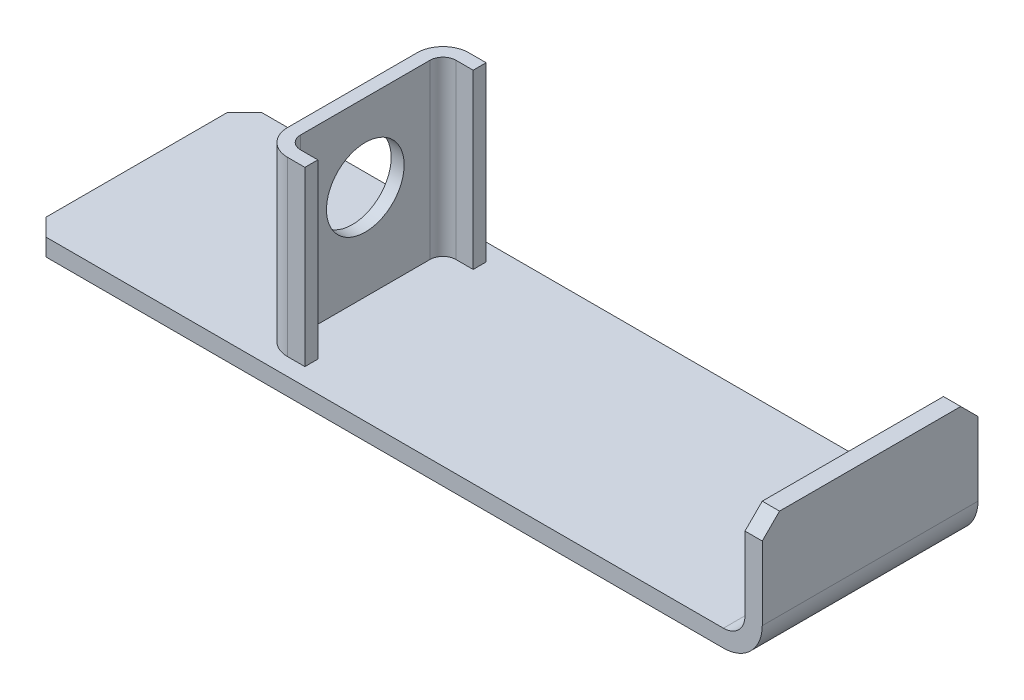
ISO-10303-21;
HEADER;
FILE_DESCRIPTION(('STEP AP214'),'2;1');
FILE_NAME('part.step','',(''),(''),'','','');
FILE_SCHEMA(('AUTOMOTIVE_DESIGN { 1 0 10303 214 1 1 1 1 }'));
ENDSEC;
DATA;
#1=APPLICATION_CONTEXT('core data for automotive mechanical design processes');
#2=APPLICATION_PROTOCOL_DEFINITION('international standard','automotive_design',2000,#1);
#3=PRODUCT_CONTEXT('',#1,'mechanical');
#4=PRODUCT('Part','Part','',(#3));
#5=PRODUCT_RELATED_PRODUCT_CATEGORY('part','',(#4));
#6=PRODUCT_DEFINITION_FORMATION('','',#4);
#7=PRODUCT_DEFINITION_CONTEXT('part definition',#1,'design');
#8=PRODUCT_DEFINITION('design','',#6,#7);
#9=PRODUCT_DEFINITION_SHAPE('','',#8);
#10=(LENGTH_UNIT() NAMED_UNIT(*) SI_UNIT(.MILLI.,.METRE.));
#11=(NAMED_UNIT(*) PLANE_ANGLE_UNIT() SI_UNIT($,.RADIAN.));
#12=(NAMED_UNIT(*) SI_UNIT($,.STERADIAN.) SOLID_ANGLE_UNIT());
#13=UNCERTAINTY_MEASURE_WITH_UNIT(LENGTH_MEASURE(1.E-05),#10,'distance_accuracy_value','');
#14=(GEOMETRIC_REPRESENTATION_CONTEXT(3) GLOBAL_UNCERTAINTY_ASSIGNED_CONTEXT((#13)) GLOBAL_UNIT_ASSIGNED_CONTEXT((#10,
#11,#12)) REPRESENTATION_CONTEXT('',''));
#15=CARTESIAN_POINT('',(0.,0.,0.));
#16=DIRECTION('',(0.,0.,1.));
#17=DIRECTION('',(1.,0.,0.));
#18=AXIS2_PLACEMENT_3D('',#15,#16,#17);
#19=CARTESIAN_POINT('',(-170.,4.,25.));
#20=DIRECTION('',(0.,1.,0.));
#21=DIRECTION('',(0.,0.,1.));
#22=AXIS2_PLACEMENT_3D('',#19,#20,#21);
#23=PLANE('',#22);
#24=DIRECTION('',(1.,0.,0.));
#25=VECTOR('',#24,1.);
#26=CARTESIAN_POINT('',(-170.,4.,-25.));
#27=LINE('',#26,#25);
#28=CARTESIAN_POINT('',(-166.,4.,-25.));
#29=VERTEX_POINT('',#28);
#30=CARTESIAN_POINT('',(-9.00000000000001,4.,-25.));
#31=VERTEX_POINT('',#30);
#32=EDGE_CURVE('E307',#29,#31,#27,.T.);
#33=ORIENTED_EDGE('',*,*,#32,.F.);
#34=DIRECTION('',(-0.707106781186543,0.,0.707106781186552));
#35=VECTOR('',#34,1.);
#36=CARTESIAN_POINT('',(-193.,4.,2.00000000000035));
#37=LINE('',#36,#35);
#38=CARTESIAN_POINT('',(-170.,4.,-20.9999999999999));
#39=VERTEX_POINT('',#38);
#40=EDGE_CURVE('E356',#29,#39,#37,.T.);
#41=ORIENTED_EDGE('',*,*,#40,.T.);
#42=DIRECTION('',(0.,0.,-1.));
#43=VECTOR('',#42,1.);
#44=CARTESIAN_POINT('',(-170.,4.,25.));
#45=LINE('',#44,#43);
#46=CARTESIAN_POINT('',(-170.,4.,21.));
#47=VERTEX_POINT('',#46);
#48=EDGE_CURVE('E336',#47,#39,#45,.T.);
#49=ORIENTED_EDGE('',*,*,#48,.F.);
#50=DIRECTION('',(-0.707106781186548,0.,-0.707106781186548));
#51=VECTOR('',#50,1.);
#52=CARTESIAN_POINT('',(-168.,4.,23.));
#53=LINE('',#52,#51);
#54=CARTESIAN_POINT('',(-166.,4.,25.));
#55=VERTEX_POINT('',#54);
#56=EDGE_CURVE('E354',#47,#55,#53,.F.);
#57=ORIENTED_EDGE('',*,*,#56,.T.);
#58=DIRECTION('',(1.,0.,0.));
#59=VECTOR('',#58,1.);
#60=CARTESIAN_POINT('',(-170.,4.,25.));
#61=LINE('',#60,#59);
#62=CARTESIAN_POINT('',(-9.00000000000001,4.,25.));
#63=VERTEX_POINT('',#62);
#64=EDGE_CURVE('E321',#55,#63,#61,.T.);
#65=ORIENTED_EDGE('',*,*,#64,.T.);
#66=DIRECTION('',(0.,0.,-1.));
#67=VECTOR('',#66,1.);
#68=CARTESIAN_POINT('',(-9.00000000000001,4.,25.));
#69=LINE('',#68,#67);
#70=EDGE_CURVE('E339',#63,#31,#69,.T.);
#71=ORIENTED_EDGE('',*,*,#70,.T.);
#72=EDGE_LOOP('',(#33,#41,#49,#57,#65,#71));
#73=FACE_BOUND('',#72,.T.);
#74=DIRECTION('',(0.,0.,1.));
#75=VECTOR('',#74,1.);
#76=CARTESIAN_POINT('',(-110.,4.,-21.));
#77=LINE('',#76,#75);
#78=CARTESIAN_POINT('',(-110.,4.,-21.));
#79=VERTEX_POINT('',#78);
#80=CARTESIAN_POINT('',(-110.,4.,-18.));
#81=VERTEX_POINT('',#80);
#82=EDGE_CURVE('E199',#79,#81,#77,.T.);
#83=ORIENTED_EDGE('',*,*,#82,.T.);
#84=DIRECTION('',(-1.,0.,0.));
#85=VECTOR('',#84,1.);
#86=CARTESIAN_POINT('',(-114.,4.,-18.));
#87=LINE('',#86,#85);
#88=CARTESIAN_POINT('',(-114.,4.,-18.));
#89=VERTEX_POINT('',#88);
#90=EDGE_CURVE('E210',#89,#81,#87,.F.);
#91=ORIENTED_EDGE('',*,*,#90,.F.);
#92=CARTESIAN_POINT('',(-114.,4.,-15.));
#93=DIRECTION('',(0.,1.,0.));
#94=DIRECTION('',(-1.,0.,0.));
#95=AXIS2_PLACEMENT_3D('',#92,#93,#94);
#96=CIRCLE('',#95,3.);
#97=CARTESIAN_POINT('',(-117.,4.,-15.));
#98=VERTEX_POINT('',#97);
#99=EDGE_CURVE('E246',#98,#89,#96,.F.);
#100=ORIENTED_EDGE('',*,*,#99,.F.);
#101=DIRECTION('',(0.,0.,1.));
#102=VECTOR('',#101,1.);
#103=CARTESIAN_POINT('',(-117.,4.,-15.));
#104=LINE('',#103,#102);
#105=CARTESIAN_POINT('',(-117.,4.,15.));
#106=VERTEX_POINT('',#105);
#107=EDGE_CURVE('E243',#106,#98,#104,.F.);
#108=ORIENTED_EDGE('',*,*,#107,.F.);
#109=CARTESIAN_POINT('',(-114.,4.,15.));
#110=DIRECTION('',(0.,1.,0.));
#111=DIRECTION('',(-1.,0.,0.));
#112=AXIS2_PLACEMENT_3D('',#109,#110,#111);
#113=CIRCLE('',#112,3.);
#114=CARTESIAN_POINT('',(-114.,4.,18.));
#115=VERTEX_POINT('',#114);
#116=EDGE_CURVE('E241',#115,#106,#113,.F.);
#117=ORIENTED_EDGE('',*,*,#116,.F.);
#118=DIRECTION('',(-1.,0.,0.));
#119=VECTOR('',#118,1.);
#120=CARTESIAN_POINT('',(-114.,4.,18.));
#121=LINE('',#120,#119);
#122=CARTESIAN_POINT('',(-110.,4.,18.));
#123=VERTEX_POINT('',#122);
#124=EDGE_CURVE('E239',#123,#115,#121,.T.);
#125=ORIENTED_EDGE('',*,*,#124,.F.);
#126=DIRECTION('',(0.,0.,1.));
#127=VECTOR('',#126,1.);
#128=CARTESIAN_POINT('',(-110.,4.,18.));
#129=LINE('',#128,#127);
#130=CARTESIAN_POINT('',(-110.,4.,21.));
#131=VERTEX_POINT('',#130);
#132=EDGE_CURVE('E236',#123,#131,#129,.T.);
#133=ORIENTED_EDGE('',*,*,#132,.T.);
#134=DIRECTION('',(-1.,0.,0.));
#135=VECTOR('',#134,1.);
#136=CARTESIAN_POINT('',(-114.,4.,21.));
#137=LINE('',#136,#135);
#138=CARTESIAN_POINT('',(-114.,4.,21.));
#139=VERTEX_POINT('',#138);
#140=EDGE_CURVE('E233',#131,#139,#137,.T.);
#141=ORIENTED_EDGE('',*,*,#140,.T.);
#142=CARTESIAN_POINT('',(-114.,4.,15.));
#143=DIRECTION('',(0.,-1.,0.));
#144=DIRECTION('',(0.,0.,1.));
#145=AXIS2_PLACEMENT_3D('',#142,#143,#144);
#146=CIRCLE('',#145,6.);
#147=CARTESIAN_POINT('',(-120.,4.,15.));
#148=VERTEX_POINT('',#147);
#149=EDGE_CURVE('E230',#139,#148,#146,.T.);
#150=ORIENTED_EDGE('',*,*,#149,.T.);
#151=DIRECTION('',(0.,0.,-1.));
#152=VECTOR('',#151,1.);
#153=CARTESIAN_POINT('',(-120.,4.,-15.));
#154=LINE('',#153,#152);
#155=CARTESIAN_POINT('',(-120.,4.,-15.));
#156=VERTEX_POINT('',#155);
#157=EDGE_CURVE('E227',#148,#156,#154,.T.);
#158=ORIENTED_EDGE('',*,*,#157,.T.);
#159=CARTESIAN_POINT('',(-114.,4.,-15.));
#160=DIRECTION('',(0.,-1.,0.));
#161=DIRECTION('',(0.,0.,-1.));
#162=AXIS2_PLACEMENT_3D('',#159,#160,#161);
#163=CIRCLE('',#162,6.);
#164=CARTESIAN_POINT('',(-114.,4.,-21.));
#165=VERTEX_POINT('',#164);
#166=EDGE_CURVE('E222',#156,#165,#163,.T.);
#167=ORIENTED_EDGE('',*,*,#166,.T.);
#168=DIRECTION('',(1.,0.,0.));
#169=VECTOR('',#168,1.);
#170=CARTESIAN_POINT('',(-114.,4.,-21.));
#171=LINE('',#170,#169);
#172=EDGE_CURVE('E220',#165,#79,#171,.T.);
#173=ORIENTED_EDGE('',*,*,#172,.T.);
#174=EDGE_LOOP('',(#83,#91,#100,#108,#117,#125,#133,#141,#150,#158,#167,#173));
#175=FACE_BOUND('',#174,.T.);
#176=ADVANCED_FACE('F33',(#73,#175),#23,.T.);
#177=CARTESIAN_POINT('',(0.,9.,25.));
#178=DIRECTION('',(-1.,0.,0.));
#179=DIRECTION('',(0.,0.,1.));
#180=AXIS2_PLACEMENT_3D('',#177,#178,#179);
#181=PLANE('',#180);
#182=DIRECTION('',(0.,1.,0.));
#183=VECTOR('',#182,1.);
#184=CARTESIAN_POINT('',(0.,9.,-25.));
#185=LINE('',#184,#183);
#186=CARTESIAN_POINT('',(0.,9.,-25.));
#187=VERTEX_POINT('',#186);
#188=CARTESIAN_POINT('',(0.,26.,-25.));
#189=VERTEX_POINT('',#188);
#190=EDGE_CURVE('E205',#187,#189,#185,.T.);
#191=ORIENTED_EDGE('',*,*,#190,.T.);
#192=DIRECTION('',(0.,0.707106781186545,0.70710678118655));
#193=VECTOR('',#192,1.);
#194=CARTESIAN_POINT('',(0.,26.,-25.));
#195=LINE('',#194,#193);
#196=CARTESIAN_POINT('',(0.,30.,-20.9999999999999));
#197=VERTEX_POINT('',#196);
#198=EDGE_CURVE('E373',#189,#197,#195,.T.);
#199=ORIENTED_EDGE('',*,*,#198,.T.);
#200=DIRECTION('',(0.,0.,-1.));
#201=VECTOR('',#200,1.);
#202=CARTESIAN_POINT('',(0.,30.,25.));
#203=LINE('',#202,#201);
#204=CARTESIAN_POINT('',(0.,30.,21.));
#205=VERTEX_POINT('',#204);
#206=EDGE_CURVE('E346',#205,#197,#203,.T.);
#207=ORIENTED_EDGE('',*,*,#206,.F.);
#208=DIRECTION('',(0.,0.707106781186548,-0.707106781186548));
#209=VECTOR('',#208,1.);
#210=CARTESIAN_POINT('',(0.,30.,21.));
#211=LINE('',#210,#209);
#212=CARTESIAN_POINT('',(0.,26.,25.));
#213=VERTEX_POINT('',#212);
#214=EDGE_CURVE('E371',#205,#213,#211,.F.);
#215=ORIENTED_EDGE('',*,*,#214,.T.);
#216=DIRECTION('',(0.,1.,0.));
#217=VECTOR('',#216,1.);
#218=CARTESIAN_POINT('',(0.,9.,25.));
#219=LINE('',#218,#217);
#220=CARTESIAN_POINT('',(0.,9.,25.));
#221=VERTEX_POINT('',#220);
#222=EDGE_CURVE('E313',#221,#213,#219,.T.);
#223=ORIENTED_EDGE('',*,*,#222,.F.);
#224=DIRECTION('',(0.,0.,-1.));
#225=VECTOR('',#224,1.);
#226=CARTESIAN_POINT('',(0.,9.,25.));
#227=LINE('',#226,#225);
#228=EDGE_CURVE('E327',#221,#187,#227,.T.);
#229=ORIENTED_EDGE('',*,*,#228,.T.);
#230=EDGE_LOOP('',(#191,#199,#207,#215,#223,#229));
#231=FACE_BOUND('',#230,.T.);
#232=ADVANCED_FACE('F35',(#231),#181,.F.);
#233=CARTESIAN_POINT('',(-4.,30.,25.));
#234=DIRECTION('',(0.,1.,0.));
#235=DIRECTION('',(0.,0.,1.));
#236=AXIS2_PLACEMENT_3D('',#233,#234,#235);
#237=PLANE('',#236);
#238=ORIENTED_EDGE('',*,*,#206,.T.);
#239=DIRECTION('',(-1.,0.,0.));
#240=VECTOR('',#239,1.);
#241=CARTESIAN_POINT('',(-4.,30.,-20.9999999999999));
#242=LINE('',#241,#240);
#243=CARTESIAN_POINT('',(-4.,30.,-20.9999999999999));
#244=VERTEX_POINT('',#243);
#245=EDGE_CURVE('E48',#197,#244,#242,.T.);
#246=ORIENTED_EDGE('',*,*,#245,.T.);
#247=DIRECTION('',(0.,0.,-1.));
#248=VECTOR('',#247,1.);
#249=CARTESIAN_POINT('',(-4.,30.,25.));
#250=LINE('',#249,#248);
#251=CARTESIAN_POINT('',(-4.,30.,21.));
#252=VERTEX_POINT('',#251);
#253=EDGE_CURVE('E344',#252,#244,#250,.T.);
#254=ORIENTED_EDGE('',*,*,#253,.F.);
#255=DIRECTION('',(1.,0.,0.));
#256=VECTOR('',#255,1.);
#257=CARTESIAN_POINT('',(-4.,30.,21.));
#258=LINE('',#257,#256);
#259=EDGE_CURVE('E375',#252,#205,#258,.T.);
#260=ORIENTED_EDGE('',*,*,#259,.T.);
#261=EDGE_LOOP('',(#238,#246,#254,#260));
#262=FACE_BOUND('',#261,.T.);
#263=ADVANCED_FACE('F380',(#262),#237,.T.);
#264=CARTESIAN_POINT('',(-4.,9.,25.));
#265=DIRECTION('',(-1.,0.,0.));
#266=DIRECTION('',(0.,0.,1.));
#267=AXIS2_PLACEMENT_3D('',#264,#265,#266);
#268=PLANE('',#267);
#269=ORIENTED_EDGE('',*,*,#253,.T.);
#270=DIRECTION('',(0.,-0.707106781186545,-0.70710678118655));
#271=VECTOR('',#270,1.);
#272=CARTESIAN_POINT('',(-4.,42.5,-8.49999999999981));
#273=LINE('',#272,#271);
#274=CARTESIAN_POINT('',(-4.,25.9999999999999,-25.));
#275=VERTEX_POINT('',#274);
#276=EDGE_CURVE('E11',#244,#275,#273,.T.);
#277=ORIENTED_EDGE('',*,*,#276,.T.);
#278=DIRECTION('',(0.,1.,0.));
#279=VECTOR('',#278,1.);
#280=CARTESIAN_POINT('',(-4.,9.,-25.));
#281=LINE('',#280,#279);
#282=CARTESIAN_POINT('',(-4.,9.,-25.));
#283=VERTEX_POINT('',#282);
#284=EDGE_CURVE('E301',#283,#275,#281,.T.);
#285=ORIENTED_EDGE('',*,*,#284,.F.);
#286=DIRECTION('',(0.,0.,-1.));
#287=VECTOR('',#286,1.);
#288=CARTESIAN_POINT('',(-4.,9.,25.));
#289=LINE('',#288,#287);
#290=CARTESIAN_POINT('',(-4.,9.,25.));
#291=VERTEX_POINT('',#290);
#292=EDGE_CURVE('E342',#291,#283,#289,.T.);
#293=ORIENTED_EDGE('',*,*,#292,.F.);
#294=DIRECTION('',(0.,1.,0.));
#295=VECTOR('',#294,1.);
#296=CARTESIAN_POINT('',(-4.,9.,25.));
#297=LINE('',#296,#295);
#298=CARTESIAN_POINT('',(-4.,26.,25.));
#299=VERTEX_POINT('',#298);
#300=EDGE_CURVE('E316',#291,#299,#297,.T.);
#301=ORIENTED_EDGE('',*,*,#300,.T.);
#302=DIRECTION('',(0.,-0.707106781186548,0.707106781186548));
#303=VECTOR('',#302,1.);
#304=CARTESIAN_POINT('',(-4.,17.5,33.5));
#305=LINE('',#304,#303);
#306=EDGE_CURVE('E41',#299,#252,#305,.F.);
#307=ORIENTED_EDGE('',*,*,#306,.T.);
#308=EDGE_LOOP('',(#269,#277,#285,#293,#301,#307));
#309=FACE_BOUND('',#308,.T.);
#310=ADVANCED_FACE('F395',(#309),#268,.T.);
#311=CARTESIAN_POINT('',(-9.,9.,25.));
#312=DIRECTION('',(0.,0.,-1.));
#313=DIRECTION('',(-1.,0.,0.));
#314=AXIS2_PLACEMENT_3D('',#311,#312,#313);
#315=CYLINDRICAL_SURFACE('',#314,5.);
#316=CARTESIAN_POINT('',(-9.,9.,-25.));
#317=DIRECTION('',(0.,0.,1.));
#318=DIRECTION('',(1.,0.,0.));
#319=AXIS2_PLACEMENT_3D('',#316,#317,#318);
#320=CIRCLE('',#319,5.);
#321=EDGE_CURVE('E304',#31,#283,#320,.T.);
#322=ORIENTED_EDGE('',*,*,#321,.F.);
#323=ORIENTED_EDGE('',*,*,#70,.F.);
#324=CARTESIAN_POINT('',(-9.,9.,25.));
#325=DIRECTION('',(0.,0.,1.));
#326=DIRECTION('',(1.,0.,0.));
#327=AXIS2_PLACEMENT_3D('',#324,#325,#326);
#328=CIRCLE('',#327,5.);
#329=EDGE_CURVE('E318',#63,#291,#328,.T.);
#330=ORIENTED_EDGE('',*,*,#329,.T.);
#331=ORIENTED_EDGE('',*,*,#292,.T.);
#332=EDGE_LOOP('',(#322,#323,#330,#331));
#333=FACE_BOUND('',#332,.T.);
#334=ADVANCED_FACE('F404',(#333),#315,.F.);
#335=CARTESIAN_POINT('',(-170.,0.,25.));
#336=DIRECTION('',(-1.,0.,0.));
#337=DIRECTION('',(0.,0.,1.));
#338=AXIS2_PLACEMENT_3D('',#335,#336,#337);
#339=PLANE('',#338);
#340=ORIENTED_EDGE('',*,*,#48,.T.);
#341=DIRECTION('',(0.,-1.,0.));
#342=VECTOR('',#341,1.);
#343=CARTESIAN_POINT('',(-170.,0.,-20.9999999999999));
#344=LINE('',#343,#342);
#345=CARTESIAN_POINT('',(-170.,0.,-20.9999999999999));
#346=VERTEX_POINT('',#345);
#347=EDGE_CURVE('E361',#39,#346,#344,.T.);
#348=ORIENTED_EDGE('',*,*,#347,.T.);
#349=DIRECTION('',(0.,0.,-1.));
#350=VECTOR('',#349,1.);
#351=CARTESIAN_POINT('',(-170.,0.,25.));
#352=LINE('',#351,#350);
#353=CARTESIAN_POINT('',(-170.,0.,21.));
#354=VERTEX_POINT('',#353);
#355=EDGE_CURVE('E333',#354,#346,#352,.T.);
#356=ORIENTED_EDGE('',*,*,#355,.F.);
#357=DIRECTION('',(0.,1.,0.));
#358=VECTOR('',#357,1.);
#359=CARTESIAN_POINT('',(-170.,0.,21.));
#360=LINE('',#359,#358);
#361=EDGE_CURVE('E358',#354,#47,#360,.T.);
#362=ORIENTED_EDGE('',*,*,#361,.T.);
#363=EDGE_LOOP('',(#340,#348,#356,#362));
#364=FACE_BOUND('',#363,.T.);
#365=ADVANCED_FACE('F420',(#364),#339,.T.);
#366=CARTESIAN_POINT('',(-170.,0.,25.));
#367=DIRECTION('',(0.,1.,0.));
#368=DIRECTION('',(0.,0.,1.));
#369=AXIS2_PLACEMENT_3D('',#366,#367,#368);
#370=PLANE('',#369);
#371=ORIENTED_EDGE('',*,*,#355,.T.);
#372=DIRECTION('',(0.707106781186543,0.,-0.707106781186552));
#373=VECTOR('',#372,1.);
#374=CARTESIAN_POINT('',(-166.,0.,-25.));
#375=LINE('',#374,#373);
#376=CARTESIAN_POINT('',(-166.,0.,-25.));
#377=VERTEX_POINT('',#376);
#378=EDGE_CURVE('E365',#346,#377,#375,.T.);
#379=ORIENTED_EDGE('',*,*,#378,.T.);
#380=DIRECTION('',(1.,0.,0.));
#381=VECTOR('',#380,1.);
#382=CARTESIAN_POINT('',(-170.,0.,-25.));
#383=LINE('',#382,#381);
#384=CARTESIAN_POINT('',(-9.00000000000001,0.,-25.));
#385=VERTEX_POINT('',#384);
#386=EDGE_CURVE('E309',#377,#385,#383,.T.);
#387=ORIENTED_EDGE('',*,*,#386,.T.);
#388=DIRECTION('',(0.,0.,-1.));
#389=VECTOR('',#388,1.);
#390=CARTESIAN_POINT('',(-9.00000000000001,0.,25.));
#391=LINE('',#390,#389);
#392=CARTESIAN_POINT('',(-9.00000000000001,0.,25.));
#393=VERTEX_POINT('',#392);
#394=EDGE_CURVE('E330',#393,#385,#391,.T.);
#395=ORIENTED_EDGE('',*,*,#394,.F.);
#396=DIRECTION('',(1.,0.,0.));
#397=VECTOR('',#396,1.);
#398=CARTESIAN_POINT('',(-170.,0.,25.));
#399=LINE('',#398,#397);
#400=CARTESIAN_POINT('',(-166.,0.,25.));
#401=VERTEX_POINT('',#400);
#402=EDGE_CURVE('E323',#401,#393,#399,.T.);
#403=ORIENTED_EDGE('',*,*,#402,.F.);
#404=DIRECTION('',(0.707106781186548,0.,0.707106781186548));
#405=VECTOR('',#404,1.);
#406=CARTESIAN_POINT('',(-170.,0.,21.));
#407=LINE('',#406,#405);
#408=EDGE_CURVE('E363',#401,#354,#407,.F.);
#409=ORIENTED_EDGE('',*,*,#408,.T.);
#410=EDGE_LOOP('',(#371,#379,#387,#395,#403,#409));
#411=FACE_BOUND('',#410,.T.);
#412=ADVANCED_FACE('F416',(#411),#370,.F.);
#413=CARTESIAN_POINT('',(-9.,9.,25.));
#414=DIRECTION('',(0.,0.,-1.));
#415=DIRECTION('',(-1.,0.,0.));
#416=AXIS2_PLACEMENT_3D('',#413,#414,#415);
#417=CYLINDRICAL_SURFACE('',#416,9.);
#418=CARTESIAN_POINT('',(-9.,9.,-25.));
#419=DIRECTION('',(0.,0.,1.));
#420=DIRECTION('',(1.,0.,0.));
#421=AXIS2_PLACEMENT_3D('',#418,#419,#420);
#422=CIRCLE('',#421,9.);
#423=EDGE_CURVE('E311',#385,#187,#422,.T.);
#424=ORIENTED_EDGE('',*,*,#423,.T.);
#425=ORIENTED_EDGE('',*,*,#228,.F.);
#426=CARTESIAN_POINT('',(-9.,9.,25.));
#427=DIRECTION('',(0.,0.,1.));
#428=DIRECTION('',(1.,0.,0.));
#429=AXIS2_PLACEMENT_3D('',#426,#427,#428);
#430=CIRCLE('',#429,9.);
#431=EDGE_CURVE('E325',#393,#221,#430,.T.);
#432=ORIENTED_EDGE('',*,*,#431,.F.);
#433=ORIENTED_EDGE('',*,*,#394,.T.);
#434=EDGE_LOOP('',(#424,#425,#432,#433));
#435=FACE_BOUND('',#434,.T.);
#436=ADVANCED_FACE('F427',(#435),#417,.T.);
#437=CARTESIAN_POINT('',(-9.,9.,25.));
#438=DIRECTION('',(0.,0.,1.));
#439=DIRECTION('',(1.,0.,0.));
#440=AXIS2_PLACEMENT_3D('',#437,#438,#439);
#441=PLANE('',#440);
#442=ORIENTED_EDGE('',*,*,#64,.F.);
#443=DIRECTION('',(0.,-1.,0.));
#444=VECTOR('',#443,1.);
#445=CARTESIAN_POINT('',(-166.,9.,25.));
#446=LINE('',#445,#444);
#447=EDGE_CURVE('E369',#55,#401,#446,.T.);
#448=ORIENTED_EDGE('',*,*,#447,.T.);
#449=ORIENTED_EDGE('',*,*,#402,.T.);
#450=ORIENTED_EDGE('',*,*,#431,.T.);
#451=ORIENTED_EDGE('',*,*,#222,.T.);
#452=DIRECTION('',(-1.,0.,0.));
#453=VECTOR('',#452,1.);
#454=CARTESIAN_POINT('',(-9.,26.,25.));
#455=LINE('',#454,#453);
#456=EDGE_CURVE('E367',#213,#299,#455,.T.);
#457=ORIENTED_EDGE('',*,*,#456,.T.);
#458=ORIENTED_EDGE('',*,*,#300,.F.);
#459=ORIENTED_EDGE('',*,*,#329,.F.);
#460=EDGE_LOOP('',(#442,#448,#449,#450,#451,#457,#458,#459));
#461=FACE_BOUND('',#460,.T.);
#462=ADVANCED_FACE('F401',(#461),#441,.T.);
#463=CARTESIAN_POINT('',(-9.,9.,-25.));
#464=DIRECTION('',(0.,0.,1.));
#465=DIRECTION('',(1.,0.,0.));
#466=AXIS2_PLACEMENT_3D('',#463,#464,#465);
#467=PLANE('',#466);
#468=ORIENTED_EDGE('',*,*,#386,.F.);
#469=DIRECTION('',(0.,1.,0.));
#470=VECTOR('',#469,1.);
#471=CARTESIAN_POINT('',(-166.,4.,-25.));
#472=LINE('',#471,#470);
#473=EDGE_CURVE('E351',#377,#29,#472,.T.);
#474=ORIENTED_EDGE('',*,*,#473,.T.);
#475=ORIENTED_EDGE('',*,*,#32,.T.);
#476=ORIENTED_EDGE('',*,*,#321,.T.);
#477=ORIENTED_EDGE('',*,*,#284,.T.);
#478=DIRECTION('',(1.,0.,0.));
#479=VECTOR('',#478,1.);
#480=CARTESIAN_POINT('',(0.,26.,-25.));
#481=LINE('',#480,#479);
#482=EDGE_CURVE('E348',#275,#189,#481,.T.);
#483=ORIENTED_EDGE('',*,*,#482,.T.);
#484=ORIENTED_EDGE('',*,*,#190,.F.);
#485=ORIENTED_EDGE('',*,*,#423,.F.);
#486=EDGE_LOOP('',(#468,#474,#475,#476,#477,#483,#484,#485));
#487=FACE_BOUND('',#486,.T.);
#488=ADVANCED_FACE('F391',(#487),#467,.F.);
#489=CARTESIAN_POINT('',(-114.,44.,-18.));
#490=DIRECTION('',(0.,0.,-1.));
#491=DIRECTION('',(-1.,0.,0.));
#492=AXIS2_PLACEMENT_3D('',#489,#490,#491);
#493=PLANE('',#492);
#494=ORIENTED_EDGE('',*,*,#90,.T.);
#495=DIRECTION('',(0.,-1.,0.));
#496=VECTOR('',#495,1.);
#497=CARTESIAN_POINT('',(-110.,44.,-18.));
#498=LINE('',#497,#496);
#499=CARTESIAN_POINT('',(-110.,44.,-18.));
#500=VERTEX_POINT('',#499);
#501=EDGE_CURVE('E195',#500,#81,#498,.T.);
#502=ORIENTED_EDGE('',*,*,#501,.F.);
#503=DIRECTION('',(-1.,0.,0.));
#504=VECTOR('',#503,1.);
#505=CARTESIAN_POINT('',(-114.,44.,-18.));
#506=LINE('',#505,#504);
#507=CARTESIAN_POINT('',(-114.,44.,-18.));
#508=VERTEX_POINT('',#507);
#509=EDGE_CURVE('E248',#508,#500,#506,.F.);
#510=ORIENTED_EDGE('',*,*,#509,.F.);
#511=DIRECTION('',(0.,-1.,0.));
#512=VECTOR('',#511,1.);
#513=CARTESIAN_POINT('',(-114.,44.,-18.));
#514=LINE('',#513,#512);
#515=EDGE_CURVE('E213',#508,#89,#514,.T.);
#516=ORIENTED_EDGE('',*,*,#515,.T.);
#517=EDGE_LOOP('',(#494,#502,#510,#516));
#518=FACE_BOUND('',#517,.T.);
#519=ADVANCED_FACE('F211',(#518),#493,.F.);
#520=CARTESIAN_POINT('',(-110.,44.,-21.));
#521=DIRECTION('',(1.,0.,0.));
#522=DIRECTION('',(0.,0.,-1.));
#523=AXIS2_PLACEMENT_3D('',#520,#521,#522);
#524=PLANE('',#523);
#525=ORIENTED_EDGE('',*,*,#82,.F.);
#526=DIRECTION('',(0.,-1.,0.));
#527=VECTOR('',#526,1.);
#528=CARTESIAN_POINT('',(-110.,44.,-21.));
#529=LINE('',#528,#527);
#530=CARTESIAN_POINT('',(-110.,44.,-21.));
#531=VERTEX_POINT('',#530);
#532=EDGE_CURVE('E206',#531,#79,#529,.T.);
#533=ORIENTED_EDGE('',*,*,#532,.F.);
#534=DIRECTION('',(0.,0.,1.));
#535=VECTOR('',#534,1.);
#536=CARTESIAN_POINT('',(-110.,44.,-21.));
#537=LINE('',#536,#535);
#538=EDGE_CURVE('E202',#531,#500,#537,.T.);
#539=ORIENTED_EDGE('',*,*,#538,.T.);
#540=ORIENTED_EDGE('',*,*,#501,.T.);
#541=EDGE_LOOP('',(#525,#533,#539,#540));
#542=FACE_BOUND('',#541,.T.);
#543=ADVANCED_FACE('F197',(#542),#524,.T.);
#544=CARTESIAN_POINT('',(-114.,44.,-21.));
#545=DIRECTION('',(0.,0.,-1.));
#546=DIRECTION('',(-1.,0.,0.));
#547=AXIS2_PLACEMENT_3D('',#544,#545,#546);
#548=PLANE('',#547);
#549=ORIENTED_EDGE('',*,*,#172,.F.);
#550=DIRECTION('',(0.,-1.,0.));
#551=VECTOR('',#550,1.);
#552=CARTESIAN_POINT('',(-114.,44.,-21.));
#553=LINE('',#552,#551);
#554=CARTESIAN_POINT('',(-114.,44.,-21.));
#555=VERTEX_POINT('',#554);
#556=EDGE_CURVE('E296',#555,#165,#553,.T.);
#557=ORIENTED_EDGE('',*,*,#556,.F.);
#558=DIRECTION('',(1.,0.,0.));
#559=VECTOR('',#558,1.);
#560=CARTESIAN_POINT('',(-114.,44.,-21.));
#561=LINE('',#560,#559);
#562=EDGE_CURVE('E251',#555,#531,#561,.T.);
#563=ORIENTED_EDGE('',*,*,#562,.T.);
#564=ORIENTED_EDGE('',*,*,#532,.T.);
#565=EDGE_LOOP('',(#549,#557,#563,#564));
#566=FACE_BOUND('',#565,.T.);
#567=ADVANCED_FACE('F501',(#566),#548,.T.);
#568=CARTESIAN_POINT('',(-114.,44.,-15.));
#569=DIRECTION('',(0.,-1.,0.));
#570=DIRECTION('',(0.,0.,-1.));
#571=AXIS2_PLACEMENT_3D('',#568,#569,#570);
#572=CYLINDRICAL_SURFACE('',#571,6.);
#573=ORIENTED_EDGE('',*,*,#166,.F.);
#574=DIRECTION('',(0.,-1.,0.));
#575=VECTOR('',#574,1.);
#576=CARTESIAN_POINT('',(-120.,44.,-15.));
#577=LINE('',#576,#575);
#578=CARTESIAN_POINT('',(-120.,44.,-15.));
#579=VERTEX_POINT('',#578);
#580=EDGE_CURVE('E294',#579,#156,#577,.T.);
#581=ORIENTED_EDGE('',*,*,#580,.F.);
#582=CARTESIAN_POINT('',(-114.,44.,-15.));
#583=DIRECTION('',(0.,-1.,0.));
#584=DIRECTION('',(0.,0.,-1.));
#585=AXIS2_PLACEMENT_3D('',#582,#583,#584);
#586=CIRCLE('',#585,6.);
#587=EDGE_CURVE('E254',#579,#555,#586,.T.);
#588=ORIENTED_EDGE('',*,*,#587,.T.);
#589=ORIENTED_EDGE('',*,*,#556,.T.);
#590=EDGE_LOOP('',(#573,#581,#588,#589));
#591=FACE_BOUND('',#590,.T.);
#592=ADVANCED_FACE('F508',(#591),#572,.T.);
#593=CARTESIAN_POINT('',(-120.,44.,-15.));
#594=DIRECTION('',(-1.,0.,0.));
#595=DIRECTION('',(0.,0.,1.));
#596=AXIS2_PLACEMENT_3D('',#593,#594,#595);
#597=PLANE('',#596);
#598=CARTESIAN_POINT('',(-120.,26.,0.));
#599=DIRECTION('',(-1.,0.,0.));
#600=DIRECTION('',(0.,0.,1.));
#601=AXIS2_PLACEMENT_3D('',#598,#599,#600);
#602=CIRCLE('',#601,9.);
#603=CARTESIAN_POINT('',(-120.,26.,9.));
#604=VERTEX_POINT('',#603);
#605=EDGE_CURVE('E679',#604,#604,#602,.F.);
#606=ORIENTED_EDGE('',*,*,#605,.T.);
#607=EDGE_LOOP('',(#606));
#608=FACE_BOUND('',#607,.T.);
#609=ORIENTED_EDGE('',*,*,#157,.F.);
#610=DIRECTION('',(0.,-1.,0.));
#611=VECTOR('',#610,1.);
#612=CARTESIAN_POINT('',(-120.,44.,15.));
#613=LINE('',#612,#611);
#614=CARTESIAN_POINT('',(-120.,44.,15.));
#615=VERTEX_POINT('',#614);
#616=EDGE_CURVE('E292',#615,#148,#613,.T.);
#617=ORIENTED_EDGE('',*,*,#616,.F.);
#618=DIRECTION('',(0.,0.,-1.));
#619=VECTOR('',#618,1.);
#620=CARTESIAN_POINT('',(-120.,44.,-15.));
#621=LINE('',#620,#619);
#622=EDGE_CURVE('E257',#615,#579,#621,.T.);
#623=ORIENTED_EDGE('',*,*,#622,.T.);
#624=ORIENTED_EDGE('',*,*,#580,.T.);
#625=EDGE_LOOP('',(#609,#617,#623,#624));
#626=FACE_BOUND('',#625,.T.);
#627=ADVANCED_FACE('F516',(#608,#626),#597,.T.);
#628=CARTESIAN_POINT('',(-114.,44.,15.));
#629=DIRECTION('',(0.,-1.,0.));
#630=DIRECTION('',(0.,0.,-1.));
#631=AXIS2_PLACEMENT_3D('',#628,#629,#630);
#632=CYLINDRICAL_SURFACE('',#631,6.);
#633=ORIENTED_EDGE('',*,*,#149,.F.);
#634=DIRECTION('',(0.,-1.,0.));
#635=VECTOR('',#634,1.);
#636=CARTESIAN_POINT('',(-114.,44.,21.));
#637=LINE('',#636,#635);
#638=CARTESIAN_POINT('',(-114.,44.,21.));
#639=VERTEX_POINT('',#638);
#640=EDGE_CURVE('E290',#639,#139,#637,.T.);
#641=ORIENTED_EDGE('',*,*,#640,.F.);
#642=CARTESIAN_POINT('',(-114.,44.,15.));
#643=DIRECTION('',(0.,-1.,0.));
#644=DIRECTION('',(0.,0.,1.));
#645=AXIS2_PLACEMENT_3D('',#642,#643,#644);
#646=CIRCLE('',#645,6.);
#647=EDGE_CURVE('E260',#639,#615,#646,.T.);
#648=ORIENTED_EDGE('',*,*,#647,.T.);
#649=ORIENTED_EDGE('',*,*,#616,.T.);
#650=EDGE_LOOP('',(#633,#641,#648,#649));
#651=FACE_BOUND('',#650,.T.);
#652=ADVANCED_FACE('F525',(#651),#632,.T.);
#653=CARTESIAN_POINT('',(-114.,44.,21.));
#654=DIRECTION('',(0.,0.,1.));
#655=DIRECTION('',(1.,0.,0.));
#656=AXIS2_PLACEMENT_3D('',#653,#654,#655);
#657=PLANE('',#656);
#658=ORIENTED_EDGE('',*,*,#140,.F.);
#659=DIRECTION('',(0.,-1.,0.));
#660=VECTOR('',#659,1.);
#661=CARTESIAN_POINT('',(-110.,44.,21.));
#662=LINE('',#661,#660);
#663=CARTESIAN_POINT('',(-110.,44.,21.));
#664=VERTEX_POINT('',#663);
#665=EDGE_CURVE('E288',#664,#131,#662,.T.);
#666=ORIENTED_EDGE('',*,*,#665,.F.);
#667=DIRECTION('',(-1.,0.,0.));
#668=VECTOR('',#667,1.);
#669=CARTESIAN_POINT('',(-114.,44.,21.));
#670=LINE('',#669,#668);
#671=EDGE_CURVE('E263',#664,#639,#670,.T.);
#672=ORIENTED_EDGE('',*,*,#671,.T.);
#673=ORIENTED_EDGE('',*,*,#640,.T.);
#674=EDGE_LOOP('',(#658,#666,#672,#673));
#675=FACE_BOUND('',#674,.T.);
#676=ADVANCED_FACE('F534',(#675),#657,.T.);
#677=CARTESIAN_POINT('',(-110.,44.,18.));
#678=DIRECTION('',(1.,0.,0.));
#679=DIRECTION('',(0.,0.,-1.));
#680=AXIS2_PLACEMENT_3D('',#677,#678,#679);
#681=PLANE('',#680);
#682=ORIENTED_EDGE('',*,*,#132,.F.);
#683=DIRECTION('',(0.,-1.,0.));
#684=VECTOR('',#683,1.);
#685=CARTESIAN_POINT('',(-110.,44.,18.));
#686=LINE('',#685,#684);
#687=CARTESIAN_POINT('',(-110.,44.,18.));
#688=VERTEX_POINT('',#687);
#689=EDGE_CURVE('E286',#688,#123,#686,.T.);
#690=ORIENTED_EDGE('',*,*,#689,.F.);
#691=DIRECTION('',(0.,0.,1.));
#692=VECTOR('',#691,1.);
#693=CARTESIAN_POINT('',(-110.,44.,18.));
#694=LINE('',#693,#692);
#695=EDGE_CURVE('E266',#688,#664,#694,.T.);
#696=ORIENTED_EDGE('',*,*,#695,.T.);
#697=ORIENTED_EDGE('',*,*,#665,.T.);
#698=EDGE_LOOP('',(#682,#690,#696,#697));
#699=FACE_BOUND('',#698,.T.);
#700=ADVANCED_FACE('F542',(#699),#681,.T.);
#701=CARTESIAN_POINT('',(-114.,44.,18.));
#702=DIRECTION('',(0.,0.,1.));
#703=DIRECTION('',(1.,0.,0.));
#704=AXIS2_PLACEMENT_3D('',#701,#702,#703);
#705=PLANE('',#704);
#706=ORIENTED_EDGE('',*,*,#124,.T.);
#707=DIRECTION('',(0.,-1.,0.));
#708=VECTOR('',#707,1.);
#709=CARTESIAN_POINT('',(-114.,44.,18.));
#710=LINE('',#709,#708);
#711=CARTESIAN_POINT('',(-114.,44.,18.));
#712=VERTEX_POINT('',#711);
#713=EDGE_CURVE('E283',#712,#115,#710,.T.);
#714=ORIENTED_EDGE('',*,*,#713,.F.);
#715=DIRECTION('',(-1.,0.,0.));
#716=VECTOR('',#715,1.);
#717=CARTESIAN_POINT('',(-114.,44.,18.));
#718=LINE('',#717,#716);
#719=EDGE_CURVE('E269',#688,#712,#718,.T.);
#720=ORIENTED_EDGE('',*,*,#719,.F.);
#721=ORIENTED_EDGE('',*,*,#689,.T.);
#722=EDGE_LOOP('',(#706,#714,#720,#721));
#723=FACE_BOUND('',#722,.T.);
#724=ADVANCED_FACE('F550',(#723),#705,.F.);
#725=CARTESIAN_POINT('',(-114.,44.,15.));
#726=DIRECTION('',(0.,-1.,0.));
#727=DIRECTION('',(0.,0.,-1.));
#728=AXIS2_PLACEMENT_3D('',#725,#726,#727);
#729=CYLINDRICAL_SURFACE('',#728,3.);
#730=ORIENTED_EDGE('',*,*,#116,.T.);
#731=DIRECTION('',(0.,-1.,0.));
#732=VECTOR('',#731,1.);
#733=CARTESIAN_POINT('',(-117.,44.,15.));
#734=LINE('',#733,#732);
#735=CARTESIAN_POINT('',(-117.,44.,15.));
#736=VERTEX_POINT('',#735);
#737=EDGE_CURVE('E280',#736,#106,#734,.T.);
#738=ORIENTED_EDGE('',*,*,#737,.F.);
#739=CARTESIAN_POINT('',(-114.,44.,15.));
#740=DIRECTION('',(0.,1.,0.));
#741=DIRECTION('',(-1.,0.,0.));
#742=AXIS2_PLACEMENT_3D('',#739,#740,#741);
#743=CIRCLE('',#742,3.);
#744=EDGE_CURVE('E271',#712,#736,#743,.F.);
#745=ORIENTED_EDGE('',*,*,#744,.F.);
#746=ORIENTED_EDGE('',*,*,#713,.T.);
#747=EDGE_LOOP('',(#730,#738,#745,#746));
#748=FACE_BOUND('',#747,.T.);
#749=ADVANCED_FACE('F558',(#748),#729,.F.);
#750=CARTESIAN_POINT('',(-117.,44.,-15.));
#751=DIRECTION('',(-1.,0.,0.));
#752=DIRECTION('',(0.,0.,1.));
#753=AXIS2_PLACEMENT_3D('',#750,#751,#752);
#754=PLANE('',#753);
#755=CARTESIAN_POINT('',(-117.,26.,0.));
#756=DIRECTION('',(1.,0.,0.));
#757=DIRECTION('',(0.,0.,-1.));
#758=AXIS2_PLACEMENT_3D('',#755,#756,#757);
#759=CIRCLE('',#758,9.);
#760=CARTESIAN_POINT('',(-117.,26.,-9.));
#761=VERTEX_POINT('',#760);
#762=EDGE_CURVE('E216',#761,#761,#759,.T.);
#763=ORIENTED_EDGE('',*,*,#762,.F.);
#764=EDGE_LOOP('',(#763));
#765=FACE_BOUND('',#764,.T.);
#766=ORIENTED_EDGE('',*,*,#107,.T.);
#767=DIRECTION('',(0.,-1.,0.));
#768=VECTOR('',#767,1.);
#769=CARTESIAN_POINT('',(-117.,44.,-15.));
#770=LINE('',#769,#768);
#771=CARTESIAN_POINT('',(-117.,44.,-15.));
#772=VERTEX_POINT('',#771);
#773=EDGE_CURVE('E278',#772,#98,#770,.T.);
#774=ORIENTED_EDGE('',*,*,#773,.F.);
#775=DIRECTION('',(0.,0.,1.));
#776=VECTOR('',#775,1.);
#777=CARTESIAN_POINT('',(-117.,44.,-15.));
#778=LINE('',#777,#776);
#779=EDGE_CURVE('E273',#736,#772,#778,.F.);
#780=ORIENTED_EDGE('',*,*,#779,.F.);
#781=ORIENTED_EDGE('',*,*,#737,.T.);
#782=EDGE_LOOP('',(#766,#774,#780,#781));
#783=FACE_BOUND('',#782,.T.);
#784=ADVANCED_FACE('F566',(#765,#783),#754,.F.);
#785=CARTESIAN_POINT('',(-114.,44.,-15.));
#786=DIRECTION('',(0.,-1.,0.));
#787=DIRECTION('',(0.,0.,-1.));
#788=AXIS2_PLACEMENT_3D('',#785,#786,#787);
#789=CYLINDRICAL_SURFACE('',#788,3.);
#790=ORIENTED_EDGE('',*,*,#99,.T.);
#791=ORIENTED_EDGE('',*,*,#515,.F.);
#792=CARTESIAN_POINT('',(-114.,44.,-15.));
#793=DIRECTION('',(0.,1.,0.));
#794=DIRECTION('',(-1.,0.,0.));
#795=AXIS2_PLACEMENT_3D('',#792,#793,#794);
#796=CIRCLE('',#795,3.);
#797=EDGE_CURVE('E275',#772,#508,#796,.F.);
#798=ORIENTED_EDGE('',*,*,#797,.F.);
#799=ORIENTED_EDGE('',*,*,#773,.T.);
#800=EDGE_LOOP('',(#790,#791,#798,#799));
#801=FACE_BOUND('',#800,.T.);
#802=ADVANCED_FACE('F574',(#801),#789,.F.);
#803=CARTESIAN_POINT('',(-114.,44.,-15.));
#804=DIRECTION('',(0.,-1.,0.));
#805=DIRECTION('',(0.,0.,-1.));
#806=AXIS2_PLACEMENT_3D('',#803,#804,#805);
#807=PLANE('',#806);
#808=ORIENTED_EDGE('',*,*,#509,.T.);
#809=ORIENTED_EDGE('',*,*,#538,.F.);
#810=ORIENTED_EDGE('',*,*,#562,.F.);
#811=ORIENTED_EDGE('',*,*,#587,.F.);
#812=ORIENTED_EDGE('',*,*,#622,.F.);
#813=ORIENTED_EDGE('',*,*,#647,.F.);
#814=ORIENTED_EDGE('',*,*,#671,.F.);
#815=ORIENTED_EDGE('',*,*,#695,.F.);
#816=ORIENTED_EDGE('',*,*,#719,.T.);
#817=ORIENTED_EDGE('',*,*,#744,.T.);
#818=ORIENTED_EDGE('',*,*,#779,.T.);
#819=ORIENTED_EDGE('',*,*,#797,.T.);
#820=EDGE_LOOP('',(#808,#809,#810,#811,#812,#813,#814,#815,#816,#817,#818,#819));
#821=FACE_BOUND('',#820,.T.);
#822=ADVANCED_FACE('F582',(#821),#807,.F.);
#823=CARTESIAN_POINT('',(-170.001,26.,0.));
#824=DIRECTION('',(1.,0.,0.));
#825=DIRECTION('',(0.,0.,-1.));
#826=AXIS2_PLACEMENT_3D('',#823,#824,#825);
#827=CYLINDRICAL_SURFACE('',#826,9.);
#828=ORIENTED_EDGE('',*,*,#605,.F.);
#829=EDGE_LOOP('',(#828));
#830=FACE_BOUND('',#829,.T.);
#831=ORIENTED_EDGE('',*,*,#762,.T.);
#832=EDGE_LOOP('',(#831));
#833=FACE_BOUND('',#832,.T.);
#834=ADVANCED_FACE('F589',(#830,#833),#827,.F.);
#835=CARTESIAN_POINT('',(-166.,9.,-25.));
#836=DIRECTION('',(-0.707106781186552,0.,-0.707106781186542));
#837=DIRECTION('',(-0.707106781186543,0.,0.707106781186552));
#838=AXIS2_PLACEMENT_3D('',#835,#836,#837);
#839=PLANE('',#838);
#840=ORIENTED_EDGE('',*,*,#378,.F.);
#841=ORIENTED_EDGE('',*,*,#347,.F.);
#842=ORIENTED_EDGE('',*,*,#40,.F.);
#843=ORIENTED_EDGE('',*,*,#473,.F.);
#844=EDGE_LOOP('',(#840,#841,#842,#843));
#845=FACE_BOUND('',#844,.T.);
#846=ADVANCED_FACE('F423',(#845),#839,.T.);
#847=CARTESIAN_POINT('',(-170.,0.,21.));
#848=DIRECTION('',(0.707106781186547,0.,-0.707106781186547));
#849=DIRECTION('',(-0.707106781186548,0.,-0.707106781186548));
#850=AXIS2_PLACEMENT_3D('',#847,#848,#849);
#851=PLANE('',#850);
#852=ORIENTED_EDGE('',*,*,#408,.F.);
#853=ORIENTED_EDGE('',*,*,#447,.F.);
#854=ORIENTED_EDGE('',*,*,#56,.F.);
#855=ORIENTED_EDGE('',*,*,#361,.F.);
#856=EDGE_LOOP('',(#852,#853,#854,#855));
#857=FACE_BOUND('',#856,.T.);
#858=ADVANCED_FACE('F412',(#857),#851,.F.);
#859=CARTESIAN_POINT('',(-9.,26.,-25.));
#860=DIRECTION('',(0.,0.70710678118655,-0.707106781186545));
#861=DIRECTION('',(0.,0.707106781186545,0.70710678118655));
#862=AXIS2_PLACEMENT_3D('',#859,#860,#861);
#863=PLANE('',#862);
#864=ORIENTED_EDGE('',*,*,#276,.F.);
#865=ORIENTED_EDGE('',*,*,#245,.F.);
#866=ORIENTED_EDGE('',*,*,#198,.F.);
#867=ORIENTED_EDGE('',*,*,#482,.F.);
#868=EDGE_LOOP('',(#864,#865,#866,#867));
#869=FACE_BOUND('',#868,.T.);
#870=ADVANCED_FACE('F388',(#869),#863,.T.);
#871=CARTESIAN_POINT('',(-4.,30.,21.));
#872=DIRECTION('',(0.,-0.707106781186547,-0.707106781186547));
#873=DIRECTION('',(0.,0.707106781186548,-0.707106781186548));
#874=AXIS2_PLACEMENT_3D('',#871,#872,#873);
#875=PLANE('',#874);
#876=ORIENTED_EDGE('',*,*,#306,.F.);
#877=ORIENTED_EDGE('',*,*,#456,.F.);
#878=ORIENTED_EDGE('',*,*,#214,.F.);
#879=ORIENTED_EDGE('',*,*,#259,.F.);
#880=EDGE_LOOP('',(#876,#877,#878,#879));
#881=FACE_BOUND('',#880,.T.);
#882=ADVANCED_FACE('F429',(#881),#875,.F.);
#883=CLOSED_SHELL('',(#176,#232,#263,#310,#334,#365,#412,#436,#462,#488,#519,#543,#567,#592,
#627,#652,#676,#700,#724,#749,#784,#802,#822,#834,#846,#858,#870,#882));
#884=MANIFOLD_SOLID_BREP('B2',#883);
#885=ADVANCED_BREP_SHAPE_REPRESENTATION('',(#18,#884),#14);
#886=SHAPE_DEFINITION_REPRESENTATION(#9,#885);
ENDSEC;
END-ISO-10303-21;
